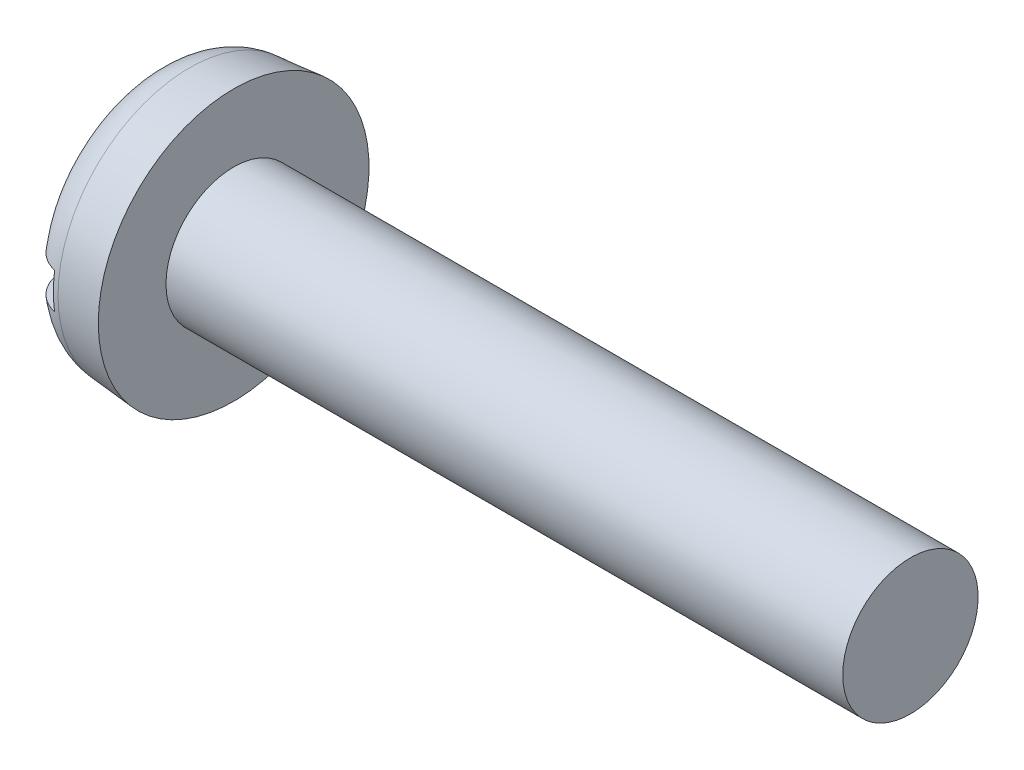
ISO-10303-21;
HEADER;
FILE_DESCRIPTION(('STEP AP214'),'2;1');
FILE_NAME('part.step','',(''),(''),'','','');
FILE_SCHEMA(('AUTOMOTIVE_DESIGN { 1 0 10303 214 1 1 1 1 }'));
ENDSEC;
DATA;
#1=APPLICATION_CONTEXT('core data for automotive mechanical design processes');
#2=APPLICATION_PROTOCOL_DEFINITION('international standard','automotive_design',2000,#1);
#3=PRODUCT_CONTEXT('',#1,'mechanical');
#4=PRODUCT('Part','Part','',(#3));
#5=PRODUCT_RELATED_PRODUCT_CATEGORY('part','',(#4));
#6=PRODUCT_DEFINITION_FORMATION('','',#4);
#7=PRODUCT_DEFINITION_CONTEXT('part definition',#1,'design');
#8=PRODUCT_DEFINITION('design','',#6,#7);
#9=PRODUCT_DEFINITION_SHAPE('','',#8);
#10=(LENGTH_UNIT() NAMED_UNIT(*) SI_UNIT(.MILLI.,.METRE.));
#11=(NAMED_UNIT(*) PLANE_ANGLE_UNIT() SI_UNIT($,.RADIAN.));
#12=(NAMED_UNIT(*) SI_UNIT($,.STERADIAN.) SOLID_ANGLE_UNIT());
#13=UNCERTAINTY_MEASURE_WITH_UNIT(LENGTH_MEASURE(1.E-05),#10,'distance_accuracy_value','');
#14=(GEOMETRIC_REPRESENTATION_CONTEXT(3) GLOBAL_UNCERTAINTY_ASSIGNED_CONTEXT((#13)) GLOBAL_UNIT_ASSIGNED_CONTEXT((#10,
#11,#12)) REPRESENTATION_CONTEXT('',''));
#15=CARTESIAN_POINT('',(0.,0.,0.));
#16=DIRECTION('',(0.,0.,1.));
#17=DIRECTION('',(1.,0.,0.));
#18=AXIS2_PLACEMENT_3D('',#15,#16,#17);
#19=CARTESIAN_POINT('',(0.,0.,0.));
#20=DIRECTION('',(-1.,0.,0.));
#21=DIRECTION('',(0.,0.,1.));
#22=AXIS2_PLACEMENT_3D('',#19,#20,#21);
#23=PLANE('',#22);
#24=DIRECTION('',(0.,0.,-1.));
#25=VECTOR('',#24,1.);
#26=CARTESIAN_POINT('',(0.,0.799999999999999,6.));
#27=LINE('',#26,#25);
#28=CARTESIAN_POINT('',(0.,0.799999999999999,3.9555566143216));
#29=VERTEX_POINT('',#28);
#30=CARTESIAN_POINT('',(0.,0.799999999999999,-3.9555566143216));
#31=VERTEX_POINT('',#30);
#32=EDGE_CURVE('E85',#29,#31,#27,.T.);
#33=ORIENTED_EDGE('',*,*,#32,.F.);
#34=CARTESIAN_POINT('',(0.,0.,0.));
#35=DIRECTION('',(-1.,0.,0.));
#36=DIRECTION('',(0.,0.,1.));
#37=AXIS2_PLACEMENT_3D('',#34,#35,#36);
#38=CIRCLE('',#37,4.03564469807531);
#39=EDGE_CURVE('E91',#29,#31,#38,.T.);
#40=ORIENTED_EDGE('',*,*,#39,.T.);
#41=EDGE_LOOP('',(#33,#40));
#42=FACE_BOUND('',#41,.T.);
#43=ADVANCED_FACE('F32',(#42),#23,.T.);
#44=CARTESIAN_POINT('',(-25.4,0.,0.));
#45=DIRECTION('',(-1.,0.,0.));
#46=DIRECTION('',(0.,0.,1.));
#47=AXIS2_PLACEMENT_3D('',#44,#45,#46);
#48=CYLINDRICAL_SURFACE('',#47,3.);
#49=CARTESIAN_POINT('',(33.6,0.,0.));
#50=DIRECTION('',(-1.,0.,0.));
#51=DIRECTION('',(0.,0.,1.));
#52=AXIS2_PLACEMENT_3D('',#49,#50,#51);
#53=CIRCLE('',#52,3.);
#54=CARTESIAN_POINT('',(33.6,0.,3.));
#55=VERTEX_POINT('',#54);
#56=EDGE_CURVE('E92',#55,#55,#53,.T.);
#57=ORIENTED_EDGE('',*,*,#56,.T.);
#58=EDGE_LOOP('',(#57));
#59=FACE_BOUND('',#58,.T.);
#60=CARTESIAN_POINT('',(3.6,0.,0.));
#61=DIRECTION('',(-1.,0.,0.));
#62=DIRECTION('',(0.,0.,1.));
#63=AXIS2_PLACEMENT_3D('',#60,#61,#62);
#64=CIRCLE('',#63,3.);
#65=CARTESIAN_POINT('',(3.6,0.,3.));
#66=VERTEX_POINT('',#65);
#67=EDGE_CURVE('E149',#66,#66,#64,.T.);
#68=ORIENTED_EDGE('',*,*,#67,.F.);
#69=EDGE_LOOP('',(#68));
#70=FACE_BOUND('',#69,.T.);
#71=ADVANCED_FACE('F137',(#59,#70),#48,.T.);
#72=CARTESIAN_POINT('',(33.6,3.,0.));
#73=DIRECTION('',(1.,0.,0.));
#74=DIRECTION('',(0.,0.,-1.));
#75=AXIS2_PLACEMENT_3D('',#72,#73,#74);
#76=PLANE('',#75);
#77=ORIENTED_EDGE('',*,*,#56,.F.);
#78=EDGE_LOOP('',(#77));
#79=FACE_BOUND('',#78,.T.);
#80=ADVANCED_FACE('F135',(#79),#76,.T.);
#81=DIRECTION('',(0.,0.,1.));
#82=VECTOR('',#81,1.);
#83=CARTESIAN_POINT('',(0.,-0.799999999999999,-6.));
#84=LINE('',#83,#82);
#85=CARTESIAN_POINT('',(0.,-0.799999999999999,-3.9555566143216));
#86=VERTEX_POINT('',#85);
#87=CARTESIAN_POINT('',(0.,-0.800000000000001,3.9555566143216));
#88=VERTEX_POINT('',#87);
#89=EDGE_CURVE('E76',#86,#88,#84,.T.);
#90=ORIENTED_EDGE('',*,*,#89,.F.);
#91=EDGE_CURVE('E83',#86,#88,#38,.T.);
#92=ORIENTED_EDGE('',*,*,#91,.T.);
#93=EDGE_LOOP('',(#90,#92));
#94=FACE_BOUND('',#93,.T.);
#95=ADVANCED_FACE('F82',(#94),#23,.T.);
#96=CARTESIAN_POINT('',(0.,0.,0.));
#97=DIRECTION('',(1.,0.,0.));
#98=DIRECTION('',(0.,0.,-1.));
#99=AXIS2_PLACEMENT_3D('',#96,#97,#98);
#100=CONICAL_SURFACE('',#99,5.68504081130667,0.0872664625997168);
#101=CARTESIAN_POINT('',(1.64311966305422,0.,0.));
#102=DIRECTION('',(-1.,0.,0.));
#103=DIRECTION('',(0.,0.,1.));
#104=AXIS2_PLACEMENT_3D('',#101,#102,#103);
#105=CIRCLE('',#104,5.82879515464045);
#106=CARTESIAN_POINT('',(1.64311966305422,0.,5.82879515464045));
#107=VERTEX_POINT('',#106);
#108=EDGE_CURVE('E95',#107,#107,#105,.F.);
#109=ORIENTED_EDGE('',*,*,#108,.T.);
#110=EDGE_LOOP('',(#109));
#111=FACE_BOUND('',#110,.T.);
#112=CARTESIAN_POINT('',(3.6,0.,0.));
#113=DIRECTION('',(-1.,0.,0.));
#114=DIRECTION('',(0.,0.,1.));
#115=AXIS2_PLACEMENT_3D('',#112,#113,#114);
#116=CIRCLE('',#115,6.);
#117=CARTESIAN_POINT('',(3.6,0.,6.));
#118=VERTEX_POINT('',#117);
#119=EDGE_CURVE('E97',#118,#118,#116,.T.);
#120=ORIENTED_EDGE('',*,*,#119,.T.);
#121=EDGE_LOOP('',(#120));
#122=FACE_BOUND('',#121,.T.);
#123=ADVANCED_FACE('F128',(#111,#122),#100,.T.);
#124=CARTESIAN_POINT('',(3.6,3.,0.));
#125=DIRECTION('',(-1.,0.,0.));
#126=DIRECTION('',(0.,0.,1.));
#127=AXIS2_PLACEMENT_3D('',#124,#125,#126);
#128=PLANE('',#127);
#129=ORIENTED_EDGE('',*,*,#119,.F.);
#130=EDGE_LOOP('',(#129));
#131=FACE_BOUND('',#130,.T.);
#132=ORIENTED_EDGE('',*,*,#67,.T.);
#133=EDGE_LOOP('',(#132));
#134=FACE_BOUND('',#133,.T.);
#135=ADVANCED_FACE('F124',(#131,#134),#128,.F.);
#136=CARTESIAN_POINT('',(1.8,0.,0.));
#137=DIRECTION('',(-1.,0.,0.));
#138=DIRECTION('',(0.,0.,1.));
#139=AXIS2_PLACEMENT_3D('',#136,#137,#138);
#140=TOROIDAL_SURFACE('',#139,4.03564469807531,1.8);
#141=CARTESIAN_POINT('',(0.540762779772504,0.799999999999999,-5.2613759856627));
#142=CARTESIAN_POINT('',(0.612348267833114,0.799999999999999,-5.33226007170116));
#143=CARTESIAN_POINT('',(0.689931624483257,0.799999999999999,-5.3971854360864));
#144=CARTESIAN_POINT('',(0.854947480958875,0.799999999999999,-5.51316161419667));
#145=CARTESIAN_POINT('',(0.94239068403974,0.799999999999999,-5.56419714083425));
#146=CARTESIAN_POINT('',(1.12461220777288,0.799999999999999,-5.650821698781));
#147=CARTESIAN_POINT('',(1.21938917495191,0.799999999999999,-5.6864135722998));
#148=CARTESIAN_POINT('',(1.41356630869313,0.799999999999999,-5.74109194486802));
#149=CARTESIAN_POINT('',(1.51296538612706,0.799999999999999,-5.76018231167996));
#150=CARTESIAN_POINT('',(1.71313899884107,0.799999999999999,-5.78126121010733));
#151=CARTESIAN_POINT('',(1.81390602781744,0.799999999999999,-5.78332104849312));
#152=CARTESIAN_POINT('',(2.01435310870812,0.799999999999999,-5.77046455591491));
#153=CARTESIAN_POINT('',(2.11403314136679,0.799999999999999,-5.75554792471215));
#154=CARTESIAN_POINT('',(2.309314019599,0.799999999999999,-5.70921606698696));
#155=CARTESIAN_POINT('',(2.40492104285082,0.799999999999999,-5.67782686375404));
#156=CARTESIAN_POINT('',(2.58952927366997,0.799999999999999,-5.59948776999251));
#157=CARTESIAN_POINT('',(2.67853045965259,0.799999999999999,-5.55253782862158));
#158=CARTESIAN_POINT('',(2.84769451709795,0.799999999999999,-5.44428887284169));
#159=CARTESIAN_POINT('',(2.92783091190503,0.799999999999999,-5.38294849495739));
#160=CARTESIAN_POINT('',(3.07676159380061,0.799999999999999,-5.24777626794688));
#161=CARTESIAN_POINT('',(3.1455556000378,0.799999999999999,-5.17394410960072));
#162=CARTESIAN_POINT('',(3.27042510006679,0.799999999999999,-5.01531035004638));
#163=CARTESIAN_POINT('',(3.32640120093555,0.799999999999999,-4.93043053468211));
#164=CARTESIAN_POINT('',(3.4235057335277,0.799999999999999,-4.75256933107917));
#165=CARTESIAN_POINT('',(3.46463341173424,0.799999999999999,-4.65958753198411));
#166=CARTESIAN_POINT('',(3.53144158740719,0.799999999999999,-4.46694835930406));
#167=CARTESIAN_POINT('',(3.55692557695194,0.799999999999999,-4.36722286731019));
#168=CARTESIAN_POINT('',(3.59108701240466,0.799999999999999,-4.16493761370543));
#169=CARTESIAN_POINT('',(3.59976314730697,0.799999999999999,-4.06237763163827));
#170=CARTESIAN_POINT('',(3.60023112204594,0.799999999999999,-3.85550711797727));
#171=CARTESIAN_POINT('',(3.59173848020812,0.799999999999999,-3.75119596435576));
#172=CARTESIAN_POINT('',(3.55768438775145,0.799999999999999,-3.54539907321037));
#173=CARTESIAN_POINT('',(3.53212117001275,0.799999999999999,-3.44391362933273));
#174=CARTESIAN_POINT('',(3.46412322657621,0.799999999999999,-3.24471369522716));
#175=CARTESIAN_POINT('',(3.42139292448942,0.799999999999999,-3.14710004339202));
#176=CARTESIAN_POINT('',(3.32030286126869,0.799999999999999,-2.96031799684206));
#177=CARTESIAN_POINT('',(3.26194098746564,0.799999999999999,-2.87115074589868));
#178=CARTESIAN_POINT('',(3.13053846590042,0.799999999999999,-2.70303664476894));
#179=CARTESIAN_POINT('',(3.05736818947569,0.799999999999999,-2.62419095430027));
#180=CARTESIAN_POINT('',(2.89859048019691,0.799999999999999,-2.48017518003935));
#181=CARTESIAN_POINT('',(2.81298317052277,0.799999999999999,-2.41500496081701));
#182=CARTESIAN_POINT('',(2.6334271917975,0.799999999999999,-2.30187272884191));
#183=CARTESIAN_POINT('',(2.53967929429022,0.799999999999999,-2.25359299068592));
#184=CARTESIAN_POINT('',(2.34507363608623,0.799999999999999,-2.17455467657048));
#185=CARTESIAN_POINT('',(2.24421969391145,0.799999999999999,-2.14378676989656));
#186=CARTESIAN_POINT('',(2.04443930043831,0.799999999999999,-2.10254396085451));
#187=CARTESIAN_POINT('',(1.94573097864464,0.799999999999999,-2.09101175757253));
#188=CARTESIAN_POINT('',(1.74783816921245,0.799999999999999,-2.08550669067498));
#189=CARTESIAN_POINT('',(1.64865381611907,0.799999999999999,-2.09152912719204));
#190=CARTESIAN_POINT('',(1.45702700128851,0.799999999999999,-2.12018138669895));
#191=CARTESIAN_POINT('',(1.36447664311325,0.799999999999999,-2.14209986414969));
#192=CARTESIAN_POINT('',(1.18420660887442,0.799999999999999,-2.20075771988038));
#193=CARTESIAN_POINT('',(1.09648771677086,0.799999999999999,-2.23749949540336));
#194=CARTESIAN_POINT('',(0.925723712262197,0.799999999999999,-2.32557805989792));
#195=CARTESIAN_POINT('',(0.842868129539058,0.799999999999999,-2.37728131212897));
#196=CARTESIAN_POINT('',(0.686362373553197,0.799999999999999,-2.493116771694));
#197=CARTESIAN_POINT('',(0.612714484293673,0.799999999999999,-2.55725205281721));
#198=CARTESIAN_POINT('',(0.472161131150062,0.799999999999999,-2.70027682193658));
#199=CARTESIAN_POINT('',(0.405916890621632,0.799999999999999,-2.77981681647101));
#200=CARTESIAN_POINT('',(0.287173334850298,0.799999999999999,-2.9485732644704));
#201=CARTESIAN_POINT('',(0.234676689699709,0.799999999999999,-3.03779159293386));
#202=CARTESIAN_POINT('',(0.143214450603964,0.799999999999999,-3.22677844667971));
#203=CARTESIAN_POINT('',(0.104782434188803,0.799999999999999,-3.32680584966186));
#204=CARTESIAN_POINT('',(0.0452446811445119,0.799999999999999,-3.5318922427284));
#205=CARTESIAN_POINT('',(0.0241387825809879,0.799999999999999,-3.63695118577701));
#206=CARTESIAN_POINT('',(-1.12670491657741E-05,0.799999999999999,-3.84916824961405));
#207=CARTESIAN_POINT('',(-0.00304965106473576,0.799999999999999,-3.95632702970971));
#208=CARTESIAN_POINT('',(0.00921984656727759,0.799999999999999,-4.16962319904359));
#209=CARTESIAN_POINT('',(0.0245310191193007,0.799999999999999,-4.27576040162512));
#210=CARTESIAN_POINT('',(0.0728327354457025,0.799999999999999,-4.48216521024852));
#211=CARTESIAN_POINT('',(0.105541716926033,0.799999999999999,-4.58249883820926));
#212=CARTESIAN_POINT('',(0.187634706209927,0.799999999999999,-4.77599767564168));
#213=CARTESIAN_POINT('',(0.236996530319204,0.799999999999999,-4.86917222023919));
#214=CARTESIAN_POINT('',(0.329466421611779,0.799999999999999,-5.01228034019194));
#215=CARTESIAN_POINT('',(0.367921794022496,0.799999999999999,-5.06527765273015));
#216=CARTESIAN_POINT('',(0.450329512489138,0.799999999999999,-5.16681267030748));
#217=CARTESIAN_POINT('',(0.494281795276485,0.799999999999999,-5.21535042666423));
#218=CARTESIAN_POINT('',(0.540762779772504,0.799999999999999,-5.2613759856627));
#219=B_SPLINE_CURVE_WITH_KNOTS('',3,(#141,#142,#143,#144,#145,#146,#147,#148,#149,#150,#151,
#152,#153,#154,#155,#156,#157,#158,#159,#160,#161,#162,#163,#164,#165,#166,#167,#168,#169,#170,
#171,#172,#173,#174,#175,#176,#177,#178,#179,#180,#181,#182,#183,#184,#185,#186,#187,#188,#189,
#190,#191,#192,#193,#194,#195,#196,#197,#198,#199,#200,#201,#202,#203,#204,#205,#206,#207,#208,
#209,#210,#211,#212,#213,#214,#215,#216,#217,#218),.UNSPECIFIED.,.T.,.F.,(4,2,2,2,2,2,2,2,2,2,2,
2,2,2,2,2,2,2,2,2,2,2,2,2,2,2,2,2,2,2,2,2,2,2,2,2,2,2,4),(0.,0.301990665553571,
0.604312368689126,0.906578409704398,1.20877358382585,1.50970282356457,1.81063738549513,
2.11109795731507,2.41155951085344,2.71289551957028,3.01423898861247,3.31784547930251,
3.6214673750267,3.92882908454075,4.23621476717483,4.54873547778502,4.86128854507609,
5.17947093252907,5.49769634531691,5.81883829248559,6.13997705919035,6.45470120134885,
6.76925749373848,7.06587349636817,7.36241009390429,7.64643650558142,7.93050886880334,
8.22223277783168,8.51402890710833,8.8231740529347,9.13237919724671,9.45232886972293,
9.77227555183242,10.0923243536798,10.4124305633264,10.7275071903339,11.042165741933,
11.2382527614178,11.4343375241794),.UNSPECIFIED.);
#220=CARTESIAN_POINT('',(1.4,0.799999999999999,-5.73510972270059));
#221=VERTEX_POINT('',#220);
#222=EDGE_CURVE('E11',#31,#221,#219,.T.);
#223=ORIENTED_EDGE('',*,*,#222,.F.);
#224=ORIENTED_EDGE('',*,*,#39,.F.);
#225=CARTESIAN_POINT('',(0.836266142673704,0.799999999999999,2.3847675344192));
#226=CARTESIAN_POINT('',(0.917616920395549,0.799999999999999,2.33037611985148));
#227=CARTESIAN_POINT('',(1.00338812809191,0.799999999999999,2.28250940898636));
#228=CARTESIAN_POINT('',(1.18171371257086,0.799999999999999,2.20157945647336));
#229=CARTESIAN_POINT('',(1.27427138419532,0.799999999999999,2.16852346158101));
#230=CARTESIAN_POINT('',(1.46387360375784,0.799999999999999,2.11861651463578));
#231=CARTESIAN_POINT('',(1.56092620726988,0.799999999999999,2.10179593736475));
#232=CARTESIAN_POINT('',(1.75645828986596,0.799999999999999,2.08531619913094));
#233=CARTESIAN_POINT('',(1.85493729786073,0.799999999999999,2.08565149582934));
#234=CARTESIAN_POINT('',(2.04724581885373,0.799999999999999,2.10316628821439));
#235=CARTESIAN_POINT('',(2.1411242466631,0.799999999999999,2.11981673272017));
#236=CARTESIAN_POINT('',(2.32483197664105,0.799999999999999,2.16840533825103));
#237=CARTESIAN_POINT('',(2.41466058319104,0.799999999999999,2.20034611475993));
#238=CARTESIAN_POINT('',(2.58937479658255,0.799999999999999,2.27883470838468));
#239=CARTESIAN_POINT('',(2.67416016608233,0.799999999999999,2.32560484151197));
#240=CARTESIAN_POINT('',(2.83527159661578,0.799999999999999,2.43194790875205));
#241=CARTESIAN_POINT('',(2.91159566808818,0.799999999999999,2.4915238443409));
#242=CARTESIAN_POINT('',(3.05833847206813,0.799999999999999,2.62557742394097));
#243=CARTESIAN_POINT('',(3.12814463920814,0.799999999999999,2.70072607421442));
#244=CARTESIAN_POINT('',(3.25476371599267,0.799999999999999,2.86127427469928));
#245=CARTESIAN_POINT('',(3.31157384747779,0.799999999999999,2.94667601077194));
#246=CARTESIAN_POINT('',(3.41282909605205,0.799999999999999,3.12914373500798));
#247=CARTESIAN_POINT('',(3.4566732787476,0.799999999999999,3.22654397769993));
#248=CARTESIAN_POINT('',(3.52749042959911,0.799999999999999,3.42730182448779));
#249=CARTESIAN_POINT('',(3.55446245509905,0.799999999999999,3.53065976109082));
#250=CARTESIAN_POINT('',(3.59074777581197,0.799999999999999,3.74099682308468));
#251=CARTESIAN_POINT('',(3.59996828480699,0.799999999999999,3.84799201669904));
#252=CARTESIAN_POINT('',(3.60003154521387,0.799999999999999,4.06199242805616));
#253=CARTESIAN_POINT('',(3.59087543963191,0.799999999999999,4.16899764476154));
#254=CARTESIAN_POINT('',(3.5545508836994,0.799999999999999,4.37828946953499));
#255=CARTESIAN_POINT('',(3.5276490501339,0.799999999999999,4.48062230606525));
#256=CARTESIAN_POINT('',(3.45672417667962,0.799999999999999,4.67917518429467));
#257=CARTESIAN_POINT('',(3.41270279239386,0.799999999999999,4.77539581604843));
#258=CARTESIAN_POINT('',(3.30967441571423,0.799999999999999,4.95711293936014));
#259=CARTESIAN_POINT('',(3.2509575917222,0.799999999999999,5.04277397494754));
#260=CARTESIAN_POINT('',(3.11977209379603,0.799999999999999,5.20282644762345));
#261=CARTESIAN_POINT('',(3.04730458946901,0.799999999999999,5.27721884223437));
#262=CARTESIAN_POINT('',(2.89186263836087,0.799999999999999,5.41145672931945));
#263=CARTESIAN_POINT('',(2.80906226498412,0.799999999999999,5.47150384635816));
#264=CARTESIAN_POINT('',(2.63447307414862,0.799999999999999,5.57667826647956));
#265=CARTESIAN_POINT('',(2.54268479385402,0.799999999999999,5.62180646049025));
#266=CARTESIAN_POINT('',(2.35372245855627,0.799999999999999,5.69541178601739));
#267=CARTESIAN_POINT('',(2.25661170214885,0.799999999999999,5.72405148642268));
#268=CARTESIAN_POINT('',(2.05894963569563,0.799999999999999,5.76452632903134));
#269=CARTESIAN_POINT('',(1.95839844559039,0.799999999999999,5.77636205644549));
#270=CARTESIAN_POINT('',(1.75726466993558,0.799999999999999,5.78286013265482));
#271=CARTESIAN_POINT('',(1.65668492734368,0.799999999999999,5.77761084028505));
#272=CARTESIAN_POINT('',(1.45783846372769,0.799999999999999,5.75028865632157));
#273=CARTESIAN_POINT('',(1.35957171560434,0.799999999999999,5.72821596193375));
#274=CARTESIAN_POINT('',(1.16819371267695,0.799999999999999,5.66791633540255));
#275=CARTESIAN_POINT('',(1.07507939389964,0.799999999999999,5.62969912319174));
#276=CARTESIAN_POINT('',(0.896555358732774,0.799999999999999,5.53823241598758));
#277=CARTESIAN_POINT('',(0.811145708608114,0.799999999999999,5.4849827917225));
#278=CARTESIAN_POINT('',(0.650082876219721,0.799999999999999,5.36476593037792));
#279=CARTESIAN_POINT('',(0.574468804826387,0.799999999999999,5.29774630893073));
#280=CARTESIAN_POINT('',(0.435451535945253,0.799999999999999,5.15205983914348));
#281=CARTESIAN_POINT('',(0.372048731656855,0.799999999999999,5.07339261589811));
#282=CARTESIAN_POINT('',(0.258650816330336,0.799999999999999,4.90594446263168));
#283=CARTESIAN_POINT('',(0.208774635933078,0.799999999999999,4.81708301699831));
#284=CARTESIAN_POINT('',(0.124428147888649,0.799999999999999,4.63233098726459));
#285=CARTESIAN_POINT('',(0.0899587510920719,0.799999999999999,4.53643998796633));
#286=CARTESIAN_POINT('',(0.0368868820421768,0.799999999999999,4.33899079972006));
#287=CARTESIAN_POINT('',(0.0185025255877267,0.799999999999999,4.23737401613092));
#288=CARTESIAN_POINT('',(-0.00125734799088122,0.799999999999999,4.03250747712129));
#289=CARTESIAN_POINT('',(-0.00263209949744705,0.799999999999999,3.9292576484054));
#290=CARTESIAN_POINT('',(0.0116307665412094,0.799999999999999,3.72214563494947));
#291=CARTESIAN_POINT('',(0.0275632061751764,0.799999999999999,3.61830377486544));
#292=CARTESIAN_POINT('',(0.0763335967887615,0.799999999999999,3.41464106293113));
#293=CARTESIAN_POINT('',(0.10917724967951,0.799999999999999,3.31482157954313));
#294=CARTESIAN_POINT('',(0.191511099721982,0.799999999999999,3.12021092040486));
#295=CARTESIAN_POINT('',(0.241286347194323,0.799999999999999,3.02554040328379));
#296=CARTESIAN_POINT('',(0.355915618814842,0.799999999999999,2.8458978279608));
#297=CARTESIAN_POINT('',(0.420755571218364,0.799999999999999,2.76091682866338));
#298=CARTESIAN_POINT('',(0.543269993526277,0.799999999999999,2.62572980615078));
#299=CARTESIAN_POINT('',(0.597683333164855,0.799999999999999,2.57253239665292));
#300=CARTESIAN_POINT('',(0.712598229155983,0.799999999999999,2.4731680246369));
#301=CARTESIAN_POINT('',(0.773099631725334,0.799999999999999,2.42700088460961));
#302=CARTESIAN_POINT('',(0.836266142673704,0.799999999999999,2.3847675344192));
#303=B_SPLINE_CURVE_WITH_KNOTS('',3,(#225,#226,#227,#228,#229,#230,#231,#232,#233,#234,#235,
#236,#237,#238,#239,#240,#241,#242,#243,#244,#245,#246,#247,#248,#249,#250,#251,#252,#253,#254,
#255,#256,#257,#258,#259,#260,#261,#262,#263,#264,#265,#266,#267,#268,#269,#270,#271,#272,#273,
#274,#275,#276,#277,#278,#279,#280,#281,#282,#283,#284,#285,#286,#287,#288,#289,#290,#291,#292,
#293,#294,#295,#296,#297,#298,#299,#300,#301,#302),.UNSPECIFIED.,.T.,.F.,(4,2,2,2,2,2,2,2,2,2,2,
2,2,2,2,2,2,2,2,2,2,2,2,2,2,2,2,2,2,2,2,2,2,2,2,2,2,2,4),(0.,0.293321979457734,
0.586787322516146,0.880800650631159,1.17471899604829,1.45941156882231,1.74415285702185,
2.03338255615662,2.32268012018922,2.62901646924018,2.93541824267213,3.25435495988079,
3.57330949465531,3.89392670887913,4.21452398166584,4.53041098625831,4.84626744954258,
5.1563211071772,5.46634840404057,5.77172128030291,6.0770759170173,6.37936593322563,
6.6816454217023,6.98236409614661,7.2830792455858,7.5836136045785,7.88415054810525,
8.18585270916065,8.48756458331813,8.79184901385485,9.09615143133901,9.40451898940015,
9.71290042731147,10.0266186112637,10.3404426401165,10.6598354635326,10.9789311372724,
11.2066928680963,11.43444884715),.UNSPECIFIED.);
#304=CARTESIAN_POINT('',(1.4,0.799999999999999,5.73510972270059));
#305=VERTEX_POINT('',#304);
#306=EDGE_CURVE('E109',#305,#29,#303,.T.);
#307=ORIENTED_EDGE('',*,*,#306,.F.);
#308=CARTESIAN_POINT('',(1.4,0.,0.));
#309=DIRECTION('',(-1.,0.,0.));
#310=DIRECTION('',(0.,0.,1.));
#311=AXIS2_PLACEMENT_3D('',#308,#309,#310);
#312=CIRCLE('',#311,5.79063757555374);
#313=CARTESIAN_POINT('',(1.4,-0.800000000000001,5.73510972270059));
#314=VERTEX_POINT('',#313);
#315=EDGE_CURVE('E103',#305,#314,#312,.F.);
#316=ORIENTED_EDGE('',*,*,#315,.T.);
#317=CARTESIAN_POINT('',(0.836266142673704,-0.8,2.3847675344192));
#318=CARTESIAN_POINT('',(0.748506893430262,-0.8,2.44345191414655));
#319=CARTESIAN_POINT('',(0.665766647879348,-0.8,2.50981960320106));
#320=CARTESIAN_POINT('',(0.512551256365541,-0.8,2.65561376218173));
#321=CARTESIAN_POINT('',(0.442099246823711,-0.8,2.73506432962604));
#322=CARTESIAN_POINT('',(0.315475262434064,-0.8,2.90443495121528));
#323=CARTESIAN_POINT('',(0.259280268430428,-0.8,2.99433778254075));
#324=CARTESIAN_POINT('',(0.162548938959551,-0.8,3.18215299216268));
#325=CARTESIAN_POINT('',(0.122006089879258,-0.8,3.28006201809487));
#326=CARTESIAN_POINT('',(0.0572425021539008,-0.8,3.4827212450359));
#327=CARTESIAN_POINT('',(0.0332676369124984,-0.8,3.58755021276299));
#328=CARTESIAN_POINT('',(0.00342578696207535,-0.8,3.79976969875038));
#329=CARTESIAN_POINT('',(-0.00244009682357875,-0.800000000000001,3.90716037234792));
#330=CARTESIAN_POINT('',(0.00425089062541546,-0.800000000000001,4.12040369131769));
#331=CARTESIAN_POINT('',(0.0166422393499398,-0.800000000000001,4.22626147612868));
#332=CARTESIAN_POINT('',(0.0593599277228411,-0.800000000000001,4.43429705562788));
#333=CARTESIAN_POINT('',(0.0896844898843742,-0.800000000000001,4.53647521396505));
#334=CARTESIAN_POINT('',(0.166811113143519,-0.800000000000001,4.73226366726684));
#335=CARTESIAN_POINT('',(0.21330327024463,-0.800000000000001,4.82599604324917));
#336=CARTESIAN_POINT('',(0.32162267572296,-0.800000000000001,5.00413844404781));
#337=CARTESIAN_POINT('',(0.383448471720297,-0.800000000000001,5.08854935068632));
#338=CARTESIAN_POINT('',(0.519544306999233,-0.800000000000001,5.24416143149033));
#339=CARTESIAN_POINT('',(0.593588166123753,-0.800000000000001,5.31556046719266));
#340=CARTESIAN_POINT('',(0.752739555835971,-0.800000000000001,5.44472836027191));
#341=CARTESIAN_POINT('',(0.837846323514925,-0.800000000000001,5.5024981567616));
#342=CARTESIAN_POINT('',(1.01558854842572,-0.800000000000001,5.60205300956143));
#343=CARTESIAN_POINT('',(1.10812041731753,-0.800000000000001,5.64402306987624));
#344=CARTESIAN_POINT('',(1.29895009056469,-0.800000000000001,5.71170590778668));
#345=CARTESIAN_POINT('',(1.39724763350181,-0.800000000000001,5.7374194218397));
#346=CARTESIAN_POINT('',(1.59606633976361,-0.800000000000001,5.77169733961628));
#347=CARTESIAN_POINT('',(1.69656671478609,-0.800000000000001,5.78038241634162));
#348=CARTESIAN_POINT('',(1.89759433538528,-0.800000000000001,5.78071120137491));
#349=CARTESIAN_POINT('',(1.99812158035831,-0.800000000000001,5.77235526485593));
#350=CARTESIAN_POINT('',(2.19609344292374,-0.800000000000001,5.73889133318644));
#351=CARTESIAN_POINT('',(2.29354498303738,-0.800000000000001,5.71382425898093));
#352=CARTESIAN_POINT('',(2.48286854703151,-0.800000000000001,5.64771711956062));
#353=CARTESIAN_POINT('',(2.57474056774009,-0.800000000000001,5.60667704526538));
#354=CARTESIAN_POINT('',(2.75051258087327,-0.800000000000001,5.50972539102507));
#355=CARTESIAN_POINT('',(2.8343959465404,-0.800000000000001,5.45378367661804));
#356=CARTESIAN_POINT('',(2.99165678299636,-0.800000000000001,5.32869697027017));
#357=CARTESIAN_POINT('',(3.06503402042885,-0.800000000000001,5.25955168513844));
#358=CARTESIAN_POINT('',(3.19973989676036,-0.800000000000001,5.10955333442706));
#359=CARTESIAN_POINT('',(3.26098586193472,-0.800000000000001,5.02862604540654));
#360=CARTESIAN_POINT('',(3.36919753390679,-0.800000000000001,4.85773374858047));
#361=CARTESIAN_POINT('',(3.41616259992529,-0.800000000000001,4.76776833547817));
#362=CARTESIAN_POINT('',(3.49507738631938,-0.800000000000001,4.5802716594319));
#363=CARTESIAN_POINT('',(3.52685014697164,-0.800000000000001,4.48266594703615));
#364=CARTESIAN_POINT('',(3.57383908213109,-0.800000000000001,4.28355151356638));
#365=CARTESIAN_POINT('',(3.58905405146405,-0.800000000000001,4.18204250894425));
#366=CARTESIAN_POINT('',(3.60277332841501,-0.800000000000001,3.97627512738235));
#367=CARTESIAN_POINT('',(3.60100695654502,-0.8,3.87199872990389));
#368=CARTESIAN_POINT('',(3.58032198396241,-0.8,3.66516328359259));
#369=CARTESIAN_POINT('',(3.56140169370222,-0.8,3.56260440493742));
#370=CARTESIAN_POINT('',(3.50655445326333,-0.8,3.3601262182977));
#371=CARTESIAN_POINT('',(3.47032341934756,-0.8,3.26028924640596));
#372=CARTESIAN_POINT('',(3.38182060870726,-0.8,3.06798854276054));
#373=CARTESIAN_POINT('',(3.32954675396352,-0.8,2.97552576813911));
#374=CARTESIAN_POINT('',(3.20964725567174,-0.8,2.79948120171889));
#375=CARTESIAN_POINT('',(3.14184223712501,-0.8,2.71602141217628));
#376=CARTESIAN_POINT('',(2.99302219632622,-0.8,2.56181483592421));
#377=CARTESIAN_POINT('',(2.91200632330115,-0.8,2.49106886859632));
#378=CARTESIAN_POINT('',(2.73997760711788,-0.8,2.36551639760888));
#379=CARTESIAN_POINT('',(2.64910309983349,-0.8,2.31052086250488));
#380=CARTESIAN_POINT('',(2.4590409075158,-0.8,2.21753014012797));
#381=CARTESIAN_POINT('',(2.35985743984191,-0.8,2.17952638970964));
#382=CARTESIAN_POINT('',(2.16147923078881,-0.8,2.12383562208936));
#383=CARTESIAN_POINT('',(2.06255196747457,-0.8,2.10519696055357));
#384=CARTESIAN_POINT('',(1.86294330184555,-0.8,2.08580594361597));
#385=CARTESIAN_POINT('',(1.76226208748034,-0.8,2.08505168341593));
#386=CARTESIAN_POINT('',(1.56749167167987,-0.8,2.1010369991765));
#387=CARTESIAN_POINT('',(1.47332742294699,-0.8,2.11688981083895));
#388=CARTESIAN_POINT('',(1.28901868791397,-0.8,2.16397488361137));
#389=CARTESIAN_POINT('',(1.19886974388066,-0.8,2.19518960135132));
#390=CARTESIAN_POINT('',(1.0638315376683,-0.8,2.25452352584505));
#391=CARTESIAN_POINT('',(1.01673933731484,-0.8,2.27777851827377));
#392=CARTESIAN_POINT('',(0.924773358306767,-0.8,2.32831196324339));
#393=CARTESIAN_POINT('',(0.879899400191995,-0.8,2.35559008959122));
#394=CARTESIAN_POINT('',(0.836266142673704,-0.8,2.3847675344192));
#395=B_SPLINE_CURVE_WITH_KNOTS('',3,(#317,#318,#319,#320,#321,#322,#323,#324,#325,#326,#327,
#328,#329,#330,#331,#332,#333,#334,#335,#336,#337,#338,#339,#340,#341,#342,#343,#344,#345,#346,
#347,#348,#349,#350,#351,#352,#353,#354,#355,#356,#357,#358,#359,#360,#361,#362,#363,#364,#365,
#366,#367,#368,#369,#370,#371,#372,#373,#374,#375,#376,#377,#378,#379,#380,#381,#382,#383,#384,
#385,#386,#387,#388,#389,#390,#391,#392,#393,#394),.UNSPECIFIED.,.T.,.F.,(4,2,2,2,2,2,2,2,2,2,2,
2,2,2,2,2,2,2,2,2,2,2,2,2,2,2,2,2,2,2,2,2,2,2,2,2,2,2,4),(0.,0.316518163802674,
0.633625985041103,0.950218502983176,1.2666791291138,1.58774070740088,1.90882180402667,
2.22700979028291,2.54516624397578,2.8575328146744,3.16986980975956,3.47696670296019,
3.78404242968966,4.08740155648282,4.39074693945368,4.69193476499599,4.99311631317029,
5.29356304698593,5.59400995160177,5.89506910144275,6.19613493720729,6.49918680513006,
6.80225226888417,7.10876667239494,7.41530338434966,7.72673423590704,8.03819576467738,
8.35534173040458,8.6725287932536,8.99358246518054,9.31465682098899,9.63169865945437,
9.94858054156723,10.2490245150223,10.549436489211,10.8345871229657,11.1194128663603,
11.276796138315,11.4341666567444),.UNSPECIFIED.);
#396=EDGE_CURVE('E90',#88,#314,#395,.T.);
#397=ORIENTED_EDGE('',*,*,#396,.F.);
#398=ORIENTED_EDGE('',*,*,#91,.F.);
#399=CARTESIAN_POINT('',(0.540762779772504,-0.799999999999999,-5.2613759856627));
#400=CARTESIAN_POINT('',(0.46800256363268,-0.799999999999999,-5.18931554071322));
#401=CARTESIAN_POINT('',(0.401331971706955,-0.799999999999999,-5.11098969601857));
#402=CARTESIAN_POINT('',(0.282092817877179,-0.799999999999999,-4.94415021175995));
#403=CARTESIAN_POINT('',(0.229543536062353,-0.799999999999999,-4.85562287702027));
#404=CARTESIAN_POINT('',(0.140058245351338,-0.799999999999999,-4.67111833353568));
#405=CARTESIAN_POINT('',(0.103104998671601,-0.799999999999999,-4.57514948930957));
#406=CARTESIAN_POINT('',(0.0456444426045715,-0.799999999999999,-4.37844736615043));
#407=CARTESIAN_POINT('',(0.0251330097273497,-0.799999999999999,-4.27771528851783));
#408=CARTESIAN_POINT('',(0.000807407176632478,-0.799999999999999,-4.07306902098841));
#409=CARTESIAN_POINT('',(-0.00280970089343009,-0.799999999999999,-3.96913144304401));
#410=CARTESIAN_POINT('',(0.00712688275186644,-0.799999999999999,-3.76207815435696));
#411=CARTESIAN_POINT('',(0.0206829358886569,-0.8,-3.65896255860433));
#412=CARTESIAN_POINT('',(0.0648595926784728,-0.8,-3.45448287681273));
#413=CARTESIAN_POINT('',(0.0957869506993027,-0.8,-3.35318504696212));
#414=CARTESIAN_POINT('',(0.173966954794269,-0.8,-3.15709227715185));
#415=CARTESIAN_POINT('',(0.221221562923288,-0.8,-3.06229812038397));
#416=CARTESIAN_POINT('',(0.331523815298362,-0.8,-2.8805427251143));
#417=CARTESIAN_POINT('',(0.394784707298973,-0.8,-2.79371074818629));
#418=CARTESIAN_POINT('',(0.535080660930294,-0.8,-2.63196239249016));
#419=CARTESIAN_POINT('',(0.612117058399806,-0.8,-2.5570471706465));
#420=CARTESIAN_POINT('',(0.777363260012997,-0.8,-2.42207446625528));
#421=CARTESIAN_POINT('',(0.865488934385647,-0.8,-2.36191424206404));
#422=CARTESIAN_POINT('',(1.05097305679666,-0.8,-2.25807126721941));
#423=CARTESIAN_POINT('',(1.1483280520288,-0.8,-2.21438238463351));
#424=CARTESIAN_POINT('',(1.34472607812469,-0.8,-2.14709500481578));
#425=CARTESIAN_POINT('',(1.44348146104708,-0.8,-2.12265879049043));
#426=CARTESIAN_POINT('',(1.64375523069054,-0.8,-2.09184121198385));
#427=CARTESIAN_POINT('',(1.74527230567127,-0.8,-2.08545142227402));
#428=CARTESIAN_POINT('',(1.94205144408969,-0.8,-2.09089422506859));
#429=CARTESIAN_POINT('',(2.03734311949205,-0.8,-2.1017185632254));
#430=CARTESIAN_POINT('',(2.22475371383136,-0.8,-2.1391955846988));
#431=CARTESIAN_POINT('',(2.31687240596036,-0.8,-2.16584939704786));
#432=CARTESIAN_POINT('',(2.49568716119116,-0.8,-2.23389898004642));
#433=CARTESIAN_POINT('',(2.58237134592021,-0.8,-2.27532580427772));
#434=CARTESIAN_POINT('',(2.74807422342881,-0.8,-2.37138684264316));
#435=CARTESIAN_POINT('',(2.82709115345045,-0.8,-2.42602408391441));
#436=CARTESIAN_POINT('',(2.9799165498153,-0.8,-2.55022645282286));
#437=CARTESIAN_POINT('',(3.05318434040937,-0.8,-2.6204569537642));
#438=CARTESIAN_POINT('',(3.18755425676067,-0.8,-2.77172635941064));
#439=CARTESIAN_POINT('',(3.24865355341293,-0.8,-2.85276777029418));
#440=CARTESIAN_POINT('',(3.35979277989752,-0.8,-3.02754470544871));
#441=CARTESIAN_POINT('',(3.40917690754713,-0.8,-3.1216981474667));
#442=CARTESIAN_POINT('',(3.49164209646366,-0.8,-3.31689856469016));
#443=CARTESIAN_POINT('',(3.52472176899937,-0.8,-3.41794612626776));
#444=CARTESIAN_POINT('',(3.57383047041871,-0.8,-3.62528781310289));
#445=CARTESIAN_POINT('',(3.58966846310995,-0.8,-3.73162733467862));
#446=CARTESIAN_POINT('',(3.60302482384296,-0.8,-3.94545563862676));
#447=CARTESIAN_POINT('',(3.60054405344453,-0.799999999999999,-4.05294436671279));
#448=CARTESIAN_POINT('',(3.57730809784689,-0.799999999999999,-4.26456838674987));
#449=CARTESIAN_POINT('',(3.5567824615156,-0.799999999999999,-4.36872882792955));
#450=CARTESIAN_POINT('',(3.49820144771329,-0.799999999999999,-4.57200098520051));
#451=CARTESIAN_POINT('',(3.46014775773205,-0.799999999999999,-4.67111318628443));
#452=CARTESIAN_POINT('',(3.36835841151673,-0.799999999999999,-4.85952398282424));
#453=CARTESIAN_POINT('',(3.31492535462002,-0.799999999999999,-4.94897001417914));
#454=CARTESIAN_POINT('',(3.19357222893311,-0.799999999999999,-5.1174283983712));
#455=CARTESIAN_POINT('',(3.12565341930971,-0.799999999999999,-5.196441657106));
#456=CARTESIAN_POINT('',(2.97843308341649,-0.799999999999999,-5.34047951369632));
#457=CARTESIAN_POINT('',(2.89932889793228,-0.799999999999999,-5.40570586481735));
#458=CARTESIAN_POINT('',(2.73119091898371,-0.799999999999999,-5.52177624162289));
#459=CARTESIAN_POINT('',(2.64215774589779,-0.799999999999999,-5.57262116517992));
#460=CARTESIAN_POINT('',(2.45774484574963,-0.799999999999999,-5.65792437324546));
#461=CARTESIAN_POINT('',(2.36244515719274,-0.799999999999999,-5.69255575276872));
#462=CARTESIAN_POINT('',(2.16736859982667,-0.799999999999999,-5.7452167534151));
#463=CARTESIAN_POINT('',(2.06759209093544,-0.799999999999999,-5.76324770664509));
#464=CARTESIAN_POINT('',(1.8670464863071,-0.799999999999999,-5.78211504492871));
#465=CARTESIAN_POINT('',(1.76628722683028,-0.799999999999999,-5.78305617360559));
#466=CARTESIAN_POINT('',(1.56601778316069,-0.799999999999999,-5.76798048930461));
#467=CARTESIAN_POINT('',(1.46650790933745,-0.799999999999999,-5.75195954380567));
#468=CARTESIAN_POINT('',(1.27169371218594,-0.799999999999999,-5.70345798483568));
#469=CARTESIAN_POINT('',(1.17638560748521,-0.799999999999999,-5.67099251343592));
#470=CARTESIAN_POINT('',(0.992639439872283,-0.799999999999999,-5.59058259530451));
#471=CARTESIAN_POINT('',(0.904192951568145,-0.799999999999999,-5.54265751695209));
#472=CARTESIAN_POINT('',(0.770167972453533,-0.799999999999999,-5.45480755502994));
#473=CARTESIAN_POINT('',(0.72159797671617,-0.799999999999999,-5.41935523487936));
#474=CARTESIAN_POINT('',(0.628240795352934,-0.799999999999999,-5.34377955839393));
#475=CARTESIAN_POINT('',(0.583453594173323,-0.799999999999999,-5.30365622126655));
#476=CARTESIAN_POINT('',(0.540762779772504,-0.799999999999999,-5.2613759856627));
#477=B_SPLINE_CURVE_WITH_KNOTS('',3,(#399,#400,#401,#402,#403,#404,#405,#406,#407,#408,#409,
#410,#411,#412,#413,#414,#415,#416,#417,#418,#419,#420,#421,#422,#423,#424,#425,#426,#427,#428,
#429,#430,#431,#432,#433,#434,#435,#436,#437,#438,#439,#440,#441,#442,#443,#444,#445,#446,#447,
#448,#449,#450,#451,#452,#453,#454,#455,#456,#457,#458,#459,#460,#461,#462,#463,#464,#465,#466,
#467,#468,#469,#470,#471,#472,#473,#474,#475,#476),.UNSPECIFIED.,.T.,.F.,(4,2,2,2,2,2,2,2,2,2,2,
2,2,2,2,2,2,2,2,2,2,2,2,2,2,2,2,2,2,2,2,2,2,2,2,2,2,2,4),(0.,0.306991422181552,0.61439988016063,
0.921467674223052,1.22845843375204,1.53902124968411,1.84962677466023,2.1658978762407,
2.48220699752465,2.80297521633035,3.12377455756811,3.4422723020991,3.76065135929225,
4.06426589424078,4.36773865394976,4.65408102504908,4.94044382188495,5.22741215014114,
5.51444629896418,5.81757894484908,6.12078198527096,6.43825439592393,6.75575384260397,
7.07673643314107,7.39770392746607,7.71464653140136,8.03155862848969,8.34261788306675,
8.65365010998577,8.95975564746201,9.2658420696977,9.56858170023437,9.87129703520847,
10.1721563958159,10.4730890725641,10.7737451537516,11.0740260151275,11.254148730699,
11.4342707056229),.UNSPECIFIED.);
#478=CARTESIAN_POINT('',(1.4,-0.799999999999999,-5.73510972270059));
#479=VERTEX_POINT('',#478);
#480=EDGE_CURVE('E44',#479,#86,#477,.T.);
#481=ORIENTED_EDGE('',*,*,#480,.F.);
#482=EDGE_CURVE('E56',#479,#221,#312,.F.);
#483=ORIENTED_EDGE('',*,*,#482,.T.);
#484=EDGE_LOOP('',(#223,#224,#307,#316,#397,#398,#481,#483));
#485=FACE_BOUND('',#484,.T.);
#486=ORIENTED_EDGE('',*,*,#108,.F.);
#487=EDGE_LOOP('',(#486));
#488=FACE_BOUND('',#487,.T.);
#489=ADVANCED_FACE('F34',(#485,#488),#140,.T.);
#490=CARTESIAN_POINT('',(1.4,0.799999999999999,6.));
#491=DIRECTION('',(0.,1.,0.));
#492=DIRECTION('',(0.,0.,1.));
#493=AXIS2_PLACEMENT_3D('',#490,#491,#492);
#494=PLANE('',#493);
#495=ORIENTED_EDGE('',*,*,#222,.T.);
#496=DIRECTION('',(0.,0.,-1.));
#497=VECTOR('',#496,1.);
#498=CARTESIAN_POINT('',(1.4,0.799999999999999,6.));
#499=LINE('',#498,#497);
#500=EDGE_CURVE('E84',#305,#221,#499,.T.);
#501=ORIENTED_EDGE('',*,*,#500,.F.);
#502=ORIENTED_EDGE('',*,*,#306,.T.);
#503=ORIENTED_EDGE('',*,*,#32,.T.);
#504=EDGE_LOOP('',(#495,#501,#502,#503));
#505=FACE_BOUND('',#504,.T.);
#506=ADVANCED_FACE('F116',(#505),#494,.F.);
#507=CARTESIAN_POINT('',(1.4,-0.799999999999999,-6.));
#508=DIRECTION('',(0.,-1.,0.));
#509=DIRECTION('',(0.,0.,-1.));
#510=AXIS2_PLACEMENT_3D('',#507,#508,#509);
#511=PLANE('',#510);
#512=ORIENTED_EDGE('',*,*,#480,.T.);
#513=ORIENTED_EDGE('',*,*,#89,.T.);
#514=ORIENTED_EDGE('',*,*,#396,.T.);
#515=DIRECTION('',(0.,0.,1.));
#516=VECTOR('',#515,1.);
#517=CARTESIAN_POINT('',(1.4,-0.799999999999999,-6.));
#518=LINE('',#517,#516);
#519=EDGE_CURVE('E51',#479,#314,#518,.T.);
#520=ORIENTED_EDGE('',*,*,#519,.F.);
#521=EDGE_LOOP('',(#512,#513,#514,#520));
#522=FACE_BOUND('',#521,.T.);
#523=ADVANCED_FACE('F75',(#522),#511,.F.);
#524=CARTESIAN_POINT('',(1.4,0.799999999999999,-6.));
#525=DIRECTION('',(-1.,0.,0.));
#526=DIRECTION('',(0.,0.,1.));
#527=AXIS2_PLACEMENT_3D('',#524,#525,#526);
#528=PLANE('',#527);
#529=ORIENTED_EDGE('',*,*,#519,.T.);
#530=ORIENTED_EDGE('',*,*,#315,.F.);
#531=ORIENTED_EDGE('',*,*,#500,.T.);
#532=ORIENTED_EDGE('',*,*,#482,.F.);
#533=EDGE_LOOP('',(#529,#530,#531,#532));
#534=FACE_BOUND('',#533,.T.);
#535=ADVANCED_FACE('F115',(#534),#528,.T.);
#536=CLOSED_SHELL('',(#43,#71,#80,#95,#123,#135,#489,#506,#523,#535));
#537=MANIFOLD_SOLID_BREP('B2',#536);
#538=ADVANCED_BREP_SHAPE_REPRESENTATION('',(#18,#537),#14);
#539=SHAPE_DEFINITION_REPRESENTATION(#9,#538);
ENDSEC;
END-ISO-10303-21;
